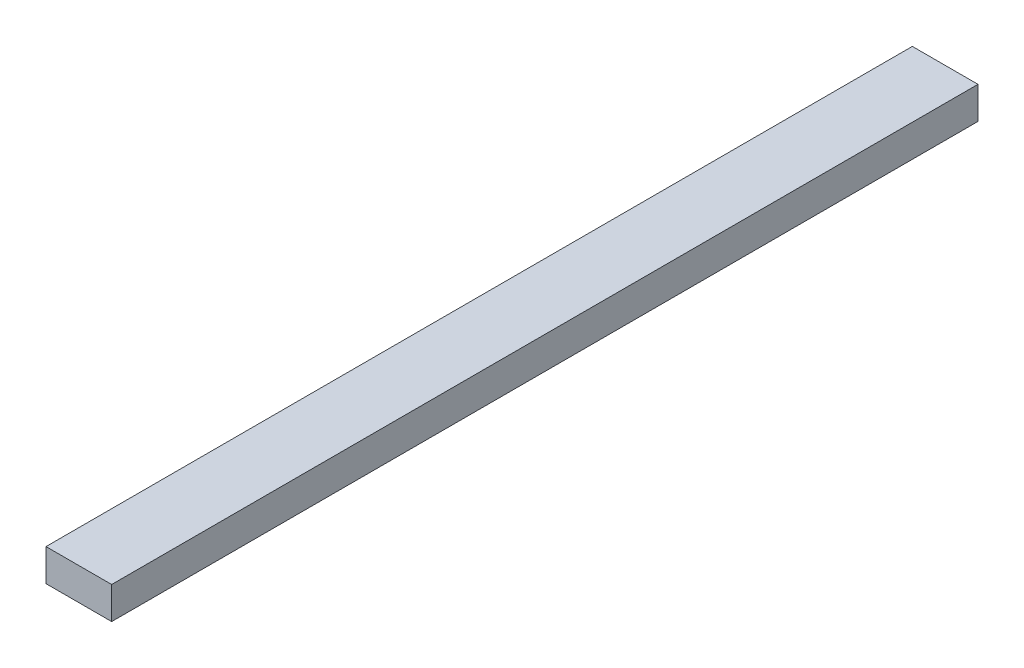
ISO-10303-21;
HEADER;
FILE_DESCRIPTION(('STEP AP214'),'2;1');
FILE_NAME('part.step','',(''),(''),'','','');
FILE_SCHEMA(('AUTOMOTIVE_DESIGN { 1 0 10303 214 1 1 1 1 }'));
ENDSEC;
DATA;
#1=APPLICATION_CONTEXT('core data for automotive mechanical design processes');
#2=APPLICATION_PROTOCOL_DEFINITION('international standard','automotive_design',2000,#1);
#3=PRODUCT_CONTEXT('',#1,'mechanical');
#4=PRODUCT('Part','Part','',(#3));
#5=PRODUCT_RELATED_PRODUCT_CATEGORY('part','',(#4));
#6=PRODUCT_DEFINITION_FORMATION('','',#4);
#7=PRODUCT_DEFINITION_CONTEXT('part definition',#1,'design');
#8=PRODUCT_DEFINITION('design','',#6,#7);
#9=PRODUCT_DEFINITION_SHAPE('','',#8);
#10=(LENGTH_UNIT() NAMED_UNIT(*) SI_UNIT(.MILLI.,.METRE.));
#11=(NAMED_UNIT(*) PLANE_ANGLE_UNIT() SI_UNIT($,.RADIAN.));
#12=(NAMED_UNIT(*) SI_UNIT($,.STERADIAN.) SOLID_ANGLE_UNIT());
#13=UNCERTAINTY_MEASURE_WITH_UNIT(LENGTH_MEASURE(1.E-05),#10,'distance_accuracy_value','');
#14=(GEOMETRIC_REPRESENTATION_CONTEXT(3) GLOBAL_UNCERTAINTY_ASSIGNED_CONTEXT((#13)) GLOBAL_UNIT_ASSIGNED_CONTEXT((#10,
#11,#12)) REPRESENTATION_CONTEXT('',''));
#15=CARTESIAN_POINT('',(0.,0.,0.));
#16=DIRECTION('',(0.,0.,1.));
#17=DIRECTION('',(1.,0.,0.));
#18=AXIS2_PLACEMENT_3D('',#15,#16,#17);
#19=CARTESIAN_POINT('',(23.5,11.5,620.));
#20=DIRECTION('',(-1.,0.,0.));
#21=DIRECTION('',(0.,-1.,0.));
#22=AXIS2_PLACEMENT_3D('',#19,#20,#21);
#23=PLANE('',#22);
#24=DIRECTION('',(0.,1.,0.));
#25=VECTOR('',#24,1.);
#26=CARTESIAN_POINT('',(23.5,11.5,0.));
#27=LINE('',#26,#25);
#28=CARTESIAN_POINT('',(23.5,-11.5,0.));
#29=VERTEX_POINT('',#28);
#30=CARTESIAN_POINT('',(23.5,11.5,0.));
#31=VERTEX_POINT('',#30);
#32=EDGE_CURVE('E95',#29,#31,#27,.T.);
#33=ORIENTED_EDGE('',*,*,#32,.T.);
#34=DIRECTION('',(0.,0.,-1.));
#35=VECTOR('',#34,1.);
#36=CARTESIAN_POINT('',(23.5,11.5,620.));
#37=LINE('',#36,#35);
#38=CARTESIAN_POINT('',(23.5,11.5,620.));
#39=VERTEX_POINT('',#38);
#40=EDGE_CURVE('E11',#39,#31,#37,.T.);
#41=ORIENTED_EDGE('',*,*,#40,.F.);
#42=DIRECTION('',(0.,1.,0.));
#43=VECTOR('',#42,1.);
#44=CARTESIAN_POINT('',(23.5,11.5,620.));
#45=LINE('',#44,#43);
#46=CARTESIAN_POINT('',(23.5,-11.5,620.));
#47=VERTEX_POINT('',#46);
#48=EDGE_CURVE('E83',#47,#39,#45,.T.);
#49=ORIENTED_EDGE('',*,*,#48,.F.);
#50=DIRECTION('',(0.,0.,-1.));
#51=VECTOR('',#50,1.);
#52=CARTESIAN_POINT('',(23.5,-11.5,620.));
#53=LINE('',#52,#51);
#54=EDGE_CURVE('E91',#47,#29,#53,.T.);
#55=ORIENTED_EDGE('',*,*,#54,.T.);
#56=EDGE_LOOP('',(#33,#41,#49,#55));
#57=FACE_BOUND('',#56,.T.);
#58=ADVANCED_FACE('F32',(#57),#23,.F.);
#59=CARTESIAN_POINT('',(-23.5,11.5,620.));
#60=DIRECTION('',(0.,-1.,0.));
#61=DIRECTION('',(0.,0.,-1.));
#62=AXIS2_PLACEMENT_3D('',#59,#60,#61);
#63=PLANE('',#62);
#64=DIRECTION('',(-1.,0.,0.));
#65=VECTOR('',#64,1.);
#66=CARTESIAN_POINT('',(-23.5,11.5,0.));
#67=LINE('',#66,#65);
#68=CARTESIAN_POINT('',(-23.5,11.5,0.));
#69=VERTEX_POINT('',#68);
#70=EDGE_CURVE('E87',#31,#69,#67,.T.);
#71=ORIENTED_EDGE('',*,*,#70,.T.);
#72=DIRECTION('',(0.,0.,-1.));
#73=VECTOR('',#72,1.);
#74=CARTESIAN_POINT('',(-23.5,11.5,620.));
#75=LINE('',#74,#73);
#76=CARTESIAN_POINT('',(-23.5,11.5,620.));
#77=VERTEX_POINT('',#76);
#78=EDGE_CURVE('E40',#77,#69,#75,.T.);
#79=ORIENTED_EDGE('',*,*,#78,.F.);
#80=DIRECTION('',(-1.,0.,0.));
#81=VECTOR('',#80,1.);
#82=CARTESIAN_POINT('',(-23.5,11.5,620.));
#83=LINE('',#82,#81);
#84=EDGE_CURVE('E78',#39,#77,#83,.T.);
#85=ORIENTED_EDGE('',*,*,#84,.F.);
#86=ORIENTED_EDGE('',*,*,#40,.T.);
#87=EDGE_LOOP('',(#71,#79,#85,#86));
#88=FACE_BOUND('',#87,.T.);
#89=ADVANCED_FACE('F86',(#88),#63,.F.);
#90=CARTESIAN_POINT('',(-23.5,11.5,620.));
#91=DIRECTION('',(1.,0.,0.));
#92=DIRECTION('',(0.,1.,0.));
#93=AXIS2_PLACEMENT_3D('',#90,#91,#92);
#94=PLANE('',#93);
#95=DIRECTION('',(0.,-1.,0.));
#96=VECTOR('',#95,1.);
#97=CARTESIAN_POINT('',(-23.5,11.5,0.));
#98=LINE('',#97,#96);
#99=CARTESIAN_POINT('',(-23.5,-11.5,0.));
#100=VERTEX_POINT('',#99);
#101=EDGE_CURVE('E65',#69,#100,#98,.T.);
#102=ORIENTED_EDGE('',*,*,#101,.T.);
#103=DIRECTION('',(0.,0.,-1.));
#104=VECTOR('',#103,1.);
#105=CARTESIAN_POINT('',(-23.5,-11.5,620.));
#106=LINE('',#105,#104);
#107=CARTESIAN_POINT('',(-23.5,-11.5,620.));
#108=VERTEX_POINT('',#107);
#109=EDGE_CURVE('E88',#108,#100,#106,.T.);
#110=ORIENTED_EDGE('',*,*,#109,.F.);
#111=DIRECTION('',(0.,-1.,0.));
#112=VECTOR('',#111,1.);
#113=CARTESIAN_POINT('',(-23.5,11.5,620.));
#114=LINE('',#113,#112);
#115=EDGE_CURVE('E81',#77,#108,#114,.T.);
#116=ORIENTED_EDGE('',*,*,#115,.F.);
#117=ORIENTED_EDGE('',*,*,#78,.T.);
#118=EDGE_LOOP('',(#102,#110,#116,#117));
#119=FACE_BOUND('',#118,.T.);
#120=ADVANCED_FACE('F89',(#119),#94,.F.);
#121=CARTESIAN_POINT('',(-23.5,-11.5,620.));
#122=DIRECTION('',(0.,1.,0.));
#123=DIRECTION('',(0.,0.,1.));
#124=AXIS2_PLACEMENT_3D('',#121,#122,#123);
#125=PLANE('',#124);
#126=DIRECTION('',(1.,0.,0.));
#127=VECTOR('',#126,1.);
#128=CARTESIAN_POINT('',(-23.5,-11.5,0.));
#129=LINE('',#128,#127);
#130=EDGE_CURVE('E71',#100,#29,#129,.T.);
#131=ORIENTED_EDGE('',*,*,#130,.T.);
#132=ORIENTED_EDGE('',*,*,#54,.F.);
#133=DIRECTION('',(1.,0.,0.));
#134=VECTOR('',#133,1.);
#135=CARTESIAN_POINT('',(-23.5,-11.5,620.));
#136=LINE('',#135,#134);
#137=EDGE_CURVE('E48',#108,#47,#136,.T.);
#138=ORIENTED_EDGE('',*,*,#137,.F.);
#139=ORIENTED_EDGE('',*,*,#109,.T.);
#140=EDGE_LOOP('',(#131,#132,#138,#139));
#141=FACE_BOUND('',#140,.T.);
#142=ADVANCED_FACE('F102',(#141),#125,.F.);
#143=CARTESIAN_POINT('',(0.,0.,620.));
#144=DIRECTION('',(0.,0.,1.));
#145=DIRECTION('',(1.,0.,0.));
#146=AXIS2_PLACEMENT_3D('',#143,#144,#145);
#147=PLANE('',#146);
#148=ORIENTED_EDGE('',*,*,#48,.T.);
#149=ORIENTED_EDGE('',*,*,#84,.T.);
#150=ORIENTED_EDGE('',*,*,#115,.T.);
#151=ORIENTED_EDGE('',*,*,#137,.T.);
#152=EDGE_LOOP('',(#148,#149,#150,#151));
#153=FACE_BOUND('',#152,.T.);
#154=ADVANCED_FACE('F79',(#153),#147,.T.);
#155=CARTESIAN_POINT('',(0.,0.,0.));
#156=DIRECTION('',(0.,0.,1.));
#157=DIRECTION('',(1.,0.,0.));
#158=AXIS2_PLACEMENT_3D('',#155,#156,#157);
#159=PLANE('',#158);
#160=ORIENTED_EDGE('',*,*,#32,.F.);
#161=ORIENTED_EDGE('',*,*,#130,.F.);
#162=ORIENTED_EDGE('',*,*,#101,.F.);
#163=ORIENTED_EDGE('',*,*,#70,.F.);
#164=EDGE_LOOP('',(#160,#161,#162,#163));
#165=FACE_BOUND('',#164,.T.);
#166=ADVANCED_FACE('F105',(#165),#159,.F.);
#167=CLOSED_SHELL('',(#58,#89,#120,#142,#154,#166));
#168=MANIFOLD_SOLID_BREP('B2',#167);
#169=ADVANCED_BREP_SHAPE_REPRESENTATION('',(#18,#168),#14);
#170=SHAPE_DEFINITION_REPRESENTATION(#9,#169);
ENDSEC;
END-ISO-10303-21;
